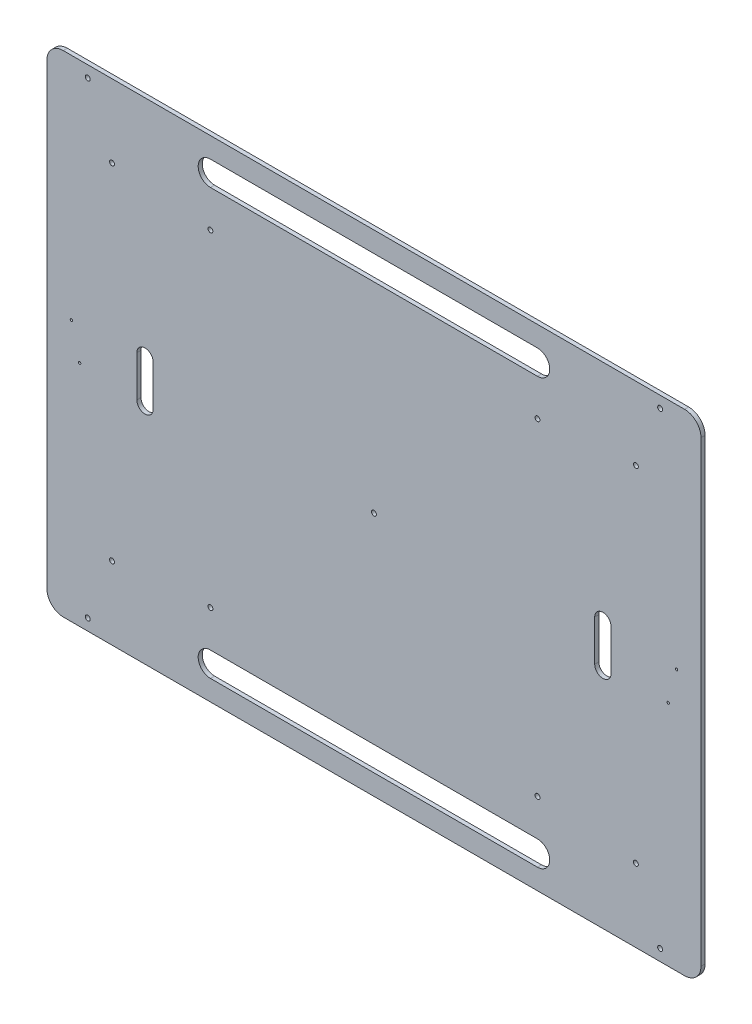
ISO-10303-21;
HEADER;
FILE_DESCRIPTION(('STEP AP214'),'2;1');
FILE_NAME('part.step','',(''),(''),'','','');
FILE_SCHEMA(('AUTOMOTIVE_DESIGN { 1 0 10303 214 1 1 1 1 }'));
ENDSEC;
DATA;
#1=APPLICATION_CONTEXT('core data for automotive mechanical design processes');
#2=APPLICATION_PROTOCOL_DEFINITION('international standard','automotive_design',2000,#1);
#3=PRODUCT_CONTEXT('',#1,'mechanical');
#4=PRODUCT('Part','Part','',(#3));
#5=PRODUCT_RELATED_PRODUCT_CATEGORY('part','',(#4));
#6=PRODUCT_DEFINITION_FORMATION('','',#4);
#7=PRODUCT_DEFINITION_CONTEXT('part definition',#1,'design');
#8=PRODUCT_DEFINITION('design','',#6,#7);
#9=PRODUCT_DEFINITION_SHAPE('','',#8);
#10=(LENGTH_UNIT() NAMED_UNIT(*) SI_UNIT(.MILLI.,.METRE.));
#11=(NAMED_UNIT(*) PLANE_ANGLE_UNIT() SI_UNIT($,.RADIAN.));
#12=(NAMED_UNIT(*) SI_UNIT($,.STERADIAN.) SOLID_ANGLE_UNIT());
#13=UNCERTAINTY_MEASURE_WITH_UNIT(LENGTH_MEASURE(1.E-05),#10,'distance_accuracy_value','');
#14=(GEOMETRIC_REPRESENTATION_CONTEXT(3) GLOBAL_UNCERTAINTY_ASSIGNED_CONTEXT((#13)) GLOBAL_UNIT_ASSIGNED_CONTEXT((#10,
#11,#12)) REPRESENTATION_CONTEXT('',''));
#15=CARTESIAN_POINT('',(0.,0.,0.));
#16=DIRECTION('',(0.,0.,1.));
#17=DIRECTION('',(1.,0.,0.));
#18=AXIS2_PLACEMENT_3D('',#15,#16,#17);
#19=CARTESIAN_POINT('',(0.,300.,5.));
#20=DIRECTION('',(0.,-1.,0.));
#21=DIRECTION('',(1.,0.,0.));
#22=AXIS2_PLACEMENT_3D('',#19,#20,#21);
#23=PLANE('',#22);
#24=DIRECTION('',(-1.,0.,0.));
#25=VECTOR('',#24,1.);
#26=CARTESIAN_POINT('',(0.,300.,5.));
#27=LINE('',#26,#25);
#28=CARTESIAN_POINT('',(-20.,300.,5.));
#29=VERTEX_POINT('',#28);
#30=CARTESIAN_POINT('',(-780.,300.,5.));
#31=VERTEX_POINT('',#30);
#32=EDGE_CURVE('E436',#29,#31,#27,.T.);
#33=ORIENTED_EDGE('',*,*,#32,.F.);
#34=DIRECTION('',(0.,0.,-1.));
#35=VECTOR('',#34,1.);
#36=CARTESIAN_POINT('',(-20.,300.,5.));
#37=LINE('',#36,#35);
#38=CARTESIAN_POINT('',(-20.,300.,0.));
#39=VERTEX_POINT('',#38);
#40=EDGE_CURVE('E11',#29,#39,#37,.T.);
#41=ORIENTED_EDGE('',*,*,#40,.T.);
#42=DIRECTION('',(-1.,0.,0.));
#43=VECTOR('',#42,1.);
#44=CARTESIAN_POINT('',(0.,300.,0.));
#45=LINE('',#44,#43);
#46=CARTESIAN_POINT('',(-780.,300.,0.));
#47=VERTEX_POINT('',#46);
#48=EDGE_CURVE('E427',#39,#47,#45,.T.);
#49=ORIENTED_EDGE('',*,*,#48,.T.);
#50=DIRECTION('',(0.,0.,-1.));
#51=VECTOR('',#50,1.);
#52=CARTESIAN_POINT('',(-780.,300.,5.));
#53=LINE('',#52,#51);
#54=EDGE_CURVE('E47',#47,#31,#53,.F.);
#55=ORIENTED_EDGE('',*,*,#54,.T.);
#56=EDGE_LOOP('',(#33,#41,#49,#55));
#57=FACE_BOUND('',#56,.T.);
#58=ADVANCED_FACE('F39',(#57),#23,.F.);
#59=CARTESIAN_POINT('',(-800.,300.,5.));
#60=DIRECTION('',(1.,0.,0.));
#61=DIRECTION('',(0.,1.,0.));
#62=AXIS2_PLACEMENT_3D('',#59,#60,#61);
#63=PLANE('',#62);
#64=DIRECTION('',(0.,-1.,0.));
#65=VECTOR('',#64,1.);
#66=CARTESIAN_POINT('',(-800.,300.,0.));
#67=LINE('',#66,#65);
#68=CARTESIAN_POINT('',(-800.,280.,0.));
#69=VERTEX_POINT('',#68);
#70=CARTESIAN_POINT('',(-800.,-280.,0.));
#71=VERTEX_POINT('',#70);
#72=EDGE_CURVE('E452',#69,#71,#67,.T.);
#73=ORIENTED_EDGE('',*,*,#72,.T.);
#74=DIRECTION('',(0.,0.,-1.));
#75=VECTOR('',#74,1.);
#76=CARTESIAN_POINT('',(-800.,-280.,5.));
#77=LINE('',#76,#75);
#78=CARTESIAN_POINT('',(-800.,-280.,5.));
#79=VERTEX_POINT('',#78);
#80=EDGE_CURVE('E475',#71,#79,#77,.F.);
#81=ORIENTED_EDGE('',*,*,#80,.T.);
#82=DIRECTION('',(0.,-1.,0.));
#83=VECTOR('',#82,1.);
#84=CARTESIAN_POINT('',(-800.,300.,5.));
#85=LINE('',#84,#83);
#86=CARTESIAN_POINT('',(-800.,280.,5.));
#87=VERTEX_POINT('',#86);
#88=EDGE_CURVE('E439',#87,#79,#85,.T.);
#89=ORIENTED_EDGE('',*,*,#88,.F.);
#90=DIRECTION('',(0.,0.,-1.));
#91=VECTOR('',#90,1.);
#92=CARTESIAN_POINT('',(-800.,280.,5.));
#93=LINE('',#92,#91);
#94=EDGE_CURVE('E472',#87,#69,#93,.T.);
#95=ORIENTED_EDGE('',*,*,#94,.T.);
#96=EDGE_LOOP('',(#73,#81,#89,#95));
#97=FACE_BOUND('',#96,.T.);
#98=ADVANCED_FACE('F503',(#97),#63,.F.);
#99=CARTESIAN_POINT('',(-800.,-300.,5.));
#100=DIRECTION('',(0.,1.,0.));
#101=DIRECTION('',(-1.,0.,0.));
#102=AXIS2_PLACEMENT_3D('',#99,#100,#101);
#103=PLANE('',#102);
#104=DIRECTION('',(1.,0.,0.));
#105=VECTOR('',#104,1.);
#106=CARTESIAN_POINT('',(-800.,-300.,5.));
#107=LINE('',#106,#105);
#108=CARTESIAN_POINT('',(-780.,-300.,5.));
#109=VERTEX_POINT('',#108);
#110=CARTESIAN_POINT('',(-19.9999999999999,-300.,5.));
#111=VERTEX_POINT('',#110);
#112=EDGE_CURVE('E443',#109,#111,#107,.T.);
#113=ORIENTED_EDGE('',*,*,#112,.F.);
#114=DIRECTION('',(0.,0.,-1.));
#115=VECTOR('',#114,1.);
#116=CARTESIAN_POINT('',(-780.,-300.,5.));
#117=LINE('',#116,#115);
#118=CARTESIAN_POINT('',(-780.,-300.,0.));
#119=VERTEX_POINT('',#118);
#120=EDGE_CURVE('E461',#109,#119,#117,.T.);
#121=ORIENTED_EDGE('',*,*,#120,.T.);
#122=DIRECTION('',(1.,0.,0.));
#123=VECTOR('',#122,1.);
#124=CARTESIAN_POINT('',(-800.,-300.,0.));
#125=LINE('',#124,#123);
#126=CARTESIAN_POINT('',(-19.9999999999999,-300.,0.));
#127=VERTEX_POINT('',#126);
#128=EDGE_CURVE('E455',#119,#127,#125,.T.);
#129=ORIENTED_EDGE('',*,*,#128,.T.);
#130=DIRECTION('',(0.,0.,-1.));
#131=VECTOR('',#130,1.);
#132=CARTESIAN_POINT('',(-19.9999999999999,-300.,5.));
#133=LINE('',#132,#131);
#134=EDGE_CURVE('E449',#127,#111,#133,.F.);
#135=ORIENTED_EDGE('',*,*,#134,.T.);
#136=EDGE_LOOP('',(#113,#121,#129,#135));
#137=FACE_BOUND('',#136,.T.);
#138=ADVANCED_FACE('F513',(#137),#103,.F.);
#139=CARTESIAN_POINT('',(0.,300.,5.));
#140=DIRECTION('',(-1.,0.,0.));
#141=DIRECTION('',(0.,-1.,0.));
#142=AXIS2_PLACEMENT_3D('',#139,#140,#141);
#143=PLANE('',#142);
#144=DIRECTION('',(0.,1.,0.));
#145=VECTOR('',#144,1.);
#146=CARTESIAN_POINT('',(0.,300.,5.));
#147=LINE('',#146,#145);
#148=CARTESIAN_POINT('',(1.08573008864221E-13,-280.,5.));
#149=VERTEX_POINT('',#148);
#150=CARTESIAN_POINT('',(0.,280.,5.));
#151=VERTEX_POINT('',#150);
#152=EDGE_CURVE('E446',#149,#151,#147,.T.);
#153=ORIENTED_EDGE('',*,*,#152,.F.);
#154=DIRECTION('',(0.,0.,-1.));
#155=VECTOR('',#154,1.);
#156=CARTESIAN_POINT('',(1.08573008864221E-13,-280.,5.));
#157=LINE('',#156,#155);
#158=CARTESIAN_POINT('',(1.08573008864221E-13,-280.,0.));
#159=VERTEX_POINT('',#158);
#160=EDGE_CURVE('E487',#149,#159,#157,.T.);
#161=ORIENTED_EDGE('',*,*,#160,.T.);
#162=DIRECTION('',(0.,1.,0.));
#163=VECTOR('',#162,1.);
#164=CARTESIAN_POINT('',(0.,300.,0.));
#165=LINE('',#164,#163);
#166=CARTESIAN_POINT('',(0.,280.,0.));
#167=VERTEX_POINT('',#166);
#168=EDGE_CURVE('E440',#159,#167,#165,.T.);
#169=ORIENTED_EDGE('',*,*,#168,.T.);
#170=DIRECTION('',(0.,0.,-1.));
#171=VECTOR('',#170,1.);
#172=CARTESIAN_POINT('',(0.,280.,5.));
#173=LINE('',#172,#171);
#174=EDGE_CURVE('E485',#167,#151,#173,.F.);
#175=ORIENTED_EDGE('',*,*,#174,.T.);
#176=EDGE_LOOP('',(#153,#161,#169,#175));
#177=FACE_BOUND('',#176,.T.);
#178=ADVANCED_FACE('F522',(#177),#143,.F.);
#179=CARTESIAN_POINT('',(0.,0.,5.));
#180=DIRECTION('',(0.,0.,1.));
#181=DIRECTION('',(1.,0.,0.));
#182=AXIS2_PLACEMENT_3D('',#179,#180,#181);
#183=PLANE('',#182);
#184=CARTESIAN_POINT('',(-600.,260.,5.));
#185=DIRECTION('',(0.,0.,1.));
#186=DIRECTION('',(1.,0.,0.));
#187=AXIS2_PLACEMENT_3D('',#184,#185,#186);
#188=CIRCLE('',#187,15.0000000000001);
#189=CARTESIAN_POINT('',(-600.,275.,5.));
#190=VERTEX_POINT('',#189);
#191=CARTESIAN_POINT('',(-600.,245.,5.));
#192=VERTEX_POINT('',#191);
#193=EDGE_CURVE('E54',#190,#192,#188,.T.);
#194=ORIENTED_EDGE('',*,*,#193,.F.);
#195=DIRECTION('',(-1.,0.,0.));
#196=VECTOR('',#195,1.);
#197=CARTESIAN_POINT('',(-600.,275.,5.));
#198=LINE('',#197,#196);
#199=CARTESIAN_POINT('',(-200.,275.,5.));
#200=VERTEX_POINT('',#199);
#201=EDGE_CURVE('E221',#200,#190,#198,.T.);
#202=ORIENTED_EDGE('',*,*,#201,.F.);
#203=CARTESIAN_POINT('',(-200.,260.,5.));
#204=DIRECTION('',(0.,0.,1.));
#205=DIRECTION('',(1.,0.,0.));
#206=AXIS2_PLACEMENT_3D('',#203,#204,#205);
#207=CIRCLE('',#206,15.0000000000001);
#208=CARTESIAN_POINT('',(-200.,245.,5.));
#209=VERTEX_POINT('',#208);
#210=EDGE_CURVE('E224',#209,#200,#207,.T.);
#211=ORIENTED_EDGE('',*,*,#210,.F.);
#212=DIRECTION('',(1.,0.,0.));
#213=VECTOR('',#212,1.);
#214=CARTESIAN_POINT('',(-600.,245.,5.));
#215=LINE('',#214,#213);
#216=EDGE_CURVE('E230',#192,#209,#215,.T.);
#217=ORIENTED_EDGE('',*,*,#216,.F.);
#218=EDGE_LOOP('',(#194,#202,#211,#217));
#219=FACE_BOUND('',#218,.T.);
#220=CARTESIAN_POINT('',(-600.,-260.,5.));
#221=DIRECTION('',(0.,0.,1.));
#222=DIRECTION('',(-1.,0.,0.));
#223=AXIS2_PLACEMENT_3D('',#220,#221,#222);
#224=CIRCLE('',#223,15.0000000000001);
#225=CARTESIAN_POINT('',(-600.,-245.,5.));
#226=VERTEX_POINT('',#225);
#227=CARTESIAN_POINT('',(-600.,-275.,5.));
#228=VERTEX_POINT('',#227);
#229=EDGE_CURVE('E62',#226,#228,#224,.T.);
#230=ORIENTED_EDGE('',*,*,#229,.F.);
#231=DIRECTION('',(-1.,0.,0.));
#232=VECTOR('',#231,1.);
#233=CARTESIAN_POINT('',(-600.,-245.,5.));
#234=LINE('',#233,#232);
#235=CARTESIAN_POINT('',(-200.,-245.,5.));
#236=VERTEX_POINT('',#235);
#237=EDGE_CURVE('E249',#236,#226,#234,.T.);
#238=ORIENTED_EDGE('',*,*,#237,.F.);
#239=CARTESIAN_POINT('',(-200.,-260.,5.));
#240=DIRECTION('',(0.,0.,1.));
#241=DIRECTION('',(-1.,0.,0.));
#242=AXIS2_PLACEMENT_3D('',#239,#240,#241);
#243=CIRCLE('',#242,15.);
#244=CARTESIAN_POINT('',(-200.,-275.,5.));
#245=VERTEX_POINT('',#244);
#246=EDGE_CURVE('E252',#245,#236,#243,.T.);
#247=ORIENTED_EDGE('',*,*,#246,.F.);
#248=DIRECTION('',(1.,0.,0.));
#249=VECTOR('',#248,1.);
#250=CARTESIAN_POINT('',(-600.,-275.,5.));
#251=LINE('',#250,#249);
#252=EDGE_CURVE('E256',#228,#245,#251,.T.);
#253=ORIENTED_EDGE('',*,*,#252,.F.);
#254=EDGE_LOOP('',(#230,#238,#247,#253));
#255=FACE_BOUND('',#254,.T.);
#256=CARTESIAN_POINT('',(-720.355339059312,-210.710678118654,5.));
#257=DIRECTION('',(0.,0.,1.));
#258=DIRECTION('',(1.,0.,0.));
#259=AXIS2_PLACEMENT_3D('',#256,#257,#258);
#260=CIRCLE('',#259,2.99999999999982);
#261=CARTESIAN_POINT('',(-717.355339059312,-210.710678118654,5.));
#262=VERTEX_POINT('',#261);
#263=EDGE_CURVE('E283',#262,#262,#260,.T.);
#264=ORIENTED_EDGE('',*,*,#263,.F.);
#265=EDGE_LOOP('',(#264));
#266=FACE_BOUND('',#265,.T.);
#267=CARTESIAN_POINT('',(-79.6446609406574,-210.710678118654,5.));
#268=DIRECTION('',(0.,0.,1.));
#269=DIRECTION('',(1.,0.,0.));
#270=AXIS2_PLACEMENT_3D('',#267,#268,#269);
#271=CIRCLE('',#270,2.99999999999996);
#272=CARTESIAN_POINT('',(-76.6446609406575,-210.710678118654,5.));
#273=VERTEX_POINT('',#272);
#274=EDGE_CURVE('E277',#273,#273,#271,.T.);
#275=ORIENTED_EDGE('',*,*,#274,.F.);
#276=EDGE_LOOP('',(#275));
#277=FACE_BOUND('',#276,.T.);
#278=CARTESIAN_POINT('',(-79.6446609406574,210.710678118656,5.));
#279=DIRECTION('',(0.,0.,1.));
#280=DIRECTION('',(1.,0.,0.));
#281=AXIS2_PLACEMENT_3D('',#278,#279,#280);
#282=CIRCLE('',#281,3.00000000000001);
#283=CARTESIAN_POINT('',(-76.6446609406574,210.710678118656,5.));
#284=VERTEX_POINT('',#283);
#285=EDGE_CURVE('E270',#284,#284,#282,.T.);
#286=ORIENTED_EDGE('',*,*,#285,.F.);
#287=EDGE_LOOP('',(#286));
#288=FACE_BOUND('',#287,.T.);
#289=CARTESIAN_POINT('',(-720.355339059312,210.710678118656,5.));
#290=DIRECTION('',(0.,0.,1.));
#291=DIRECTION('',(1.,0.,0.));
#292=AXIS2_PLACEMENT_3D('',#289,#290,#291);
#293=CIRCLE('',#292,2.99999999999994);
#294=CARTESIAN_POINT('',(-717.355339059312,210.710678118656,5.));
#295=VERTEX_POINT('',#294);
#296=EDGE_CURVE('E273',#295,#295,#293,.T.);
#297=ORIENTED_EDGE('',*,*,#296,.F.);
#298=EDGE_LOOP('',(#297));
#299=FACE_BOUND('',#298,.T.);
#300=CARTESIAN_POINT('',(-400.,0.,5.));
#301=DIRECTION('',(0.,0.,1.));
#302=DIRECTION('',(1.,0.,0.));
#303=AXIS2_PLACEMENT_3D('',#300,#301,#302);
#304=CIRCLE('',#303,2.99999999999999);
#305=CARTESIAN_POINT('',(-397.,0.,5.));
#306=VERTEX_POINT('',#305);
#307=EDGE_CURVE('E313',#306,#306,#304,.T.);
#308=ORIENTED_EDGE('',*,*,#307,.F.);
#309=EDGE_LOOP('',(#308));
#310=FACE_BOUND('',#309,.T.);
#311=CARTESIAN_POINT('',(-600.,-200.,5.));
#312=DIRECTION('',(0.,0.,1.));
#313=DIRECTION('',(1.,0.,0.));
#314=AXIS2_PLACEMENT_3D('',#311,#312,#313);
#315=CIRCLE('',#314,2.99999999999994);
#316=CARTESIAN_POINT('',(-597.,-200.,5.));
#317=VERTEX_POINT('',#316);
#318=EDGE_CURVE('E307',#317,#317,#315,.T.);
#319=ORIENTED_EDGE('',*,*,#318,.F.);
#320=EDGE_LOOP('',(#319));
#321=FACE_BOUND('',#320,.T.);
#322=CARTESIAN_POINT('',(-200.,-200.,5.));
#323=DIRECTION('',(0.,0.,1.));
#324=DIRECTION('',(1.,0.,0.));
#325=AXIS2_PLACEMENT_3D('',#322,#323,#324);
#326=CIRCLE('',#325,2.99999999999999);
#327=CARTESIAN_POINT('',(-197.,-200.,5.));
#328=VERTEX_POINT('',#327);
#329=EDGE_CURVE('E301',#328,#328,#326,.T.);
#330=ORIENTED_EDGE('',*,*,#329,.F.);
#331=EDGE_LOOP('',(#330));
#332=FACE_BOUND('',#331,.T.);
#333=CARTESIAN_POINT('',(-200.,200.,5.));
#334=DIRECTION('',(0.,0.,1.));
#335=DIRECTION('',(1.,0.,0.));
#336=AXIS2_PLACEMENT_3D('',#333,#334,#335);
#337=CIRCLE('',#336,2.99999999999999);
#338=CARTESIAN_POINT('',(-197.,200.,5.));
#339=VERTEX_POINT('',#338);
#340=EDGE_CURVE('E294',#339,#339,#337,.T.);
#341=ORIENTED_EDGE('',*,*,#340,.F.);
#342=EDGE_LOOP('',(#341));
#343=FACE_BOUND('',#342,.T.);
#344=CARTESIAN_POINT('',(-600.,200.,5.));
#345=DIRECTION('',(0.,0.,1.));
#346=DIRECTION('',(1.,0.,0.));
#347=AXIS2_PLACEMENT_3D('',#344,#345,#346);
#348=CIRCLE('',#347,3.00000000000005);
#349=CARTESIAN_POINT('',(-597.,200.,5.));
#350=VERTEX_POINT('',#349);
#351=EDGE_CURVE('E297',#350,#350,#348,.T.);
#352=ORIENTED_EDGE('',*,*,#351,.F.);
#353=EDGE_LOOP('',(#352));
#354=FACE_BOUND('',#353,.T.);
#355=CARTESIAN_POINT('',(-749.999999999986,-285.999999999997,5.));
#356=DIRECTION('',(0.,0.,-1.));
#357=DIRECTION('',(-1.,0.,0.));
#358=AXIS2_PLACEMENT_3D('',#355,#356,#357);
#359=CIRCLE('',#358,3.00000000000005);
#360=CARTESIAN_POINT('',(-752.999999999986,-285.999999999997,5.));
#361=VERTEX_POINT('',#360);
#362=EDGE_CURVE('E334',#361,#361,#359,.T.);
#363=ORIENTED_EDGE('',*,*,#362,.T.);
#364=EDGE_LOOP('',(#363));
#365=FACE_BOUND('',#364,.T.);
#366=CARTESIAN_POINT('',(-49.9999999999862,286.000000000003,5.));
#367=DIRECTION('',(0.,0.,-1.));
#368=DIRECTION('',(-1.,0.,0.));
#369=AXIS2_PLACEMENT_3D('',#366,#367,#368);
#370=CIRCLE('',#369,3.00000000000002);
#371=CARTESIAN_POINT('',(-52.9999999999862,286.000000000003,5.));
#372=VERTEX_POINT('',#371);
#373=EDGE_CURVE('E327',#372,#372,#370,.T.);
#374=ORIENTED_EDGE('',*,*,#373,.T.);
#375=EDGE_LOOP('',(#374));
#376=FACE_BOUND('',#375,.T.);
#377=CARTESIAN_POINT('',(-749.999999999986,286.000000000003,5.));
#378=DIRECTION('',(0.,0.,-1.));
#379=DIRECTION('',(-1.,0.,0.));
#380=AXIS2_PLACEMENT_3D('',#377,#378,#379);
#381=CIRCLE('',#380,2.99999999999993);
#382=CARTESIAN_POINT('',(-752.999999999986,286.000000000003,5.));
#383=VERTEX_POINT('',#382);
#384=EDGE_CURVE('E321',#383,#383,#381,.T.);
#385=ORIENTED_EDGE('',*,*,#384,.T.);
#386=EDGE_LOOP('',(#385));
#387=FACE_BOUND('',#386,.T.);
#388=CARTESIAN_POINT('',(-49.9999999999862,-285.999999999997,5.));
#389=DIRECTION('',(0.,0.,-1.));
#390=DIRECTION('',(-1.,0.,0.));
#391=AXIS2_PLACEMENT_3D('',#388,#389,#390);
#392=CIRCLE('',#391,3.00000000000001);
#393=CARTESIAN_POINT('',(-52.9999999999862,-285.999999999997,5.));
#394=VERTEX_POINT('',#393);
#395=EDGE_CURVE('E342',#394,#394,#392,.T.);
#396=ORIENTED_EDGE('',*,*,#395,.T.);
#397=EDGE_LOOP('',(#396));
#398=FACE_BOUND('',#397,.T.);
#399=CARTESIAN_POINT('',(-680.,25.,5.));
#400=DIRECTION('',(0.,0.,1.));
#401=DIRECTION('',(1.,0.,0.));
#402=AXIS2_PLACEMENT_3D('',#399,#400,#401);
#403=CIRCLE('',#402,10.0000000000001);
#404=CARTESIAN_POINT('',(-670.,25.,5.));
#405=VERTEX_POINT('',#404);
#406=CARTESIAN_POINT('',(-690.,25.,5.));
#407=VERTEX_POINT('',#406);
#408=EDGE_CURVE('E362',#405,#407,#403,.T.);
#409=ORIENTED_EDGE('',*,*,#408,.F.);
#410=DIRECTION('',(0.,1.,0.));
#411=VECTOR('',#410,1.);
#412=CARTESIAN_POINT('',(-670.,25.,5.));
#413=LINE('',#412,#411);
#414=CARTESIAN_POINT('',(-670.,-25.,5.));
#415=VERTEX_POINT('',#414);
#416=EDGE_CURVE('E352',#415,#405,#413,.T.);
#417=ORIENTED_EDGE('',*,*,#416,.F.);
#418=CARTESIAN_POINT('',(-680.,-25.,5.));
#419=DIRECTION('',(0.,0.,1.));
#420=DIRECTION('',(1.,0.,0.));
#421=AXIS2_PLACEMENT_3D('',#418,#419,#420);
#422=CIRCLE('',#421,10.0000000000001);
#423=CARTESIAN_POINT('',(-690.,-25.,5.));
#424=VERTEX_POINT('',#423);
#425=EDGE_CURVE('E368',#424,#415,#422,.T.);
#426=ORIENTED_EDGE('',*,*,#425,.F.);
#427=DIRECTION('',(0.,-1.,0.));
#428=VECTOR('',#427,1.);
#429=CARTESIAN_POINT('',(-690.,25.,5.));
#430=LINE('',#429,#428);
#431=EDGE_CURVE('E364',#407,#424,#430,.T.);
#432=ORIENTED_EDGE('',*,*,#431,.F.);
#433=EDGE_LOOP('',(#409,#417,#426,#432));
#434=FACE_BOUND('',#433,.T.);
#435=CARTESIAN_POINT('',(-120.,25.0000000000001,5.));
#436=DIRECTION('',(0.,0.,1.));
#437=DIRECTION('',(-1.,0.,0.));
#438=AXIS2_PLACEMENT_3D('',#435,#436,#437);
#439=CIRCLE('',#438,10.0000000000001);
#440=CARTESIAN_POINT('',(-110.,25.0000000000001,5.));
#441=VERTEX_POINT('',#440);
#442=CARTESIAN_POINT('',(-130.,25.0000000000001,5.));
#443=VERTEX_POINT('',#442);
#444=EDGE_CURVE('E365',#441,#443,#439,.T.);
#445=ORIENTED_EDGE('',*,*,#444,.F.);
#446=DIRECTION('',(0.,1.,0.));
#447=VECTOR('',#446,1.);
#448=CARTESIAN_POINT('',(-110.,25.0000000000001,5.));
#449=LINE('',#448,#447);
#450=CARTESIAN_POINT('',(-110.,-24.9999999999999,5.));
#451=VERTEX_POINT('',#450);
#452=EDGE_CURVE('E391',#451,#441,#449,.T.);
#453=ORIENTED_EDGE('',*,*,#452,.F.);
#454=CARTESIAN_POINT('',(-120.,-24.9999999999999,5.));
#455=DIRECTION('',(0.,0.,1.));
#456=DIRECTION('',(-1.,0.,0.));
#457=AXIS2_PLACEMENT_3D('',#454,#455,#456);
#458=CIRCLE('',#457,10.0000000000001);
#459=CARTESIAN_POINT('',(-130.,-24.9999999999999,5.));
#460=VERTEX_POINT('',#459);
#461=EDGE_CURVE('E394',#460,#451,#458,.T.);
#462=ORIENTED_EDGE('',*,*,#461,.F.);
#463=DIRECTION('',(0.,-1.,0.));
#464=VECTOR('',#463,1.);
#465=CARTESIAN_POINT('',(-130.,25.0000000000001,5.));
#466=LINE('',#465,#464);
#467=EDGE_CURVE('E398',#443,#460,#466,.T.);
#468=ORIENTED_EDGE('',*,*,#467,.F.);
#469=EDGE_LOOP('',(#445,#453,#462,#468));
#470=FACE_BOUND('',#469,.T.);
#471=CARTESIAN_POINT('',(-29.9700628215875,19.6356832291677,5.));
#472=DIRECTION('',(0.,0.,1.));
#473=DIRECTION('',(1.,0.,0.));
#474=AXIS2_PLACEMENT_3D('',#471,#472,#473);
#475=CIRCLE('',#474,1.50000000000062);
#476=CARTESIAN_POINT('',(-28.4700628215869,19.6356832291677,5.));
#477=VERTEX_POINT('',#476);
#478=EDGE_CURVE('E416',#477,#477,#475,.T.);
#479=ORIENTED_EDGE('',*,*,#478,.F.);
#480=EDGE_LOOP('',(#479));
#481=FACE_BOUND('',#480,.T.);
#482=CARTESIAN_POINT('',(-770.029937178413,19.6356832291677,5.));
#483=DIRECTION('',(0.,0.,1.));
#484=DIRECTION('',(-1.,0.,0.));
#485=AXIS2_PLACEMENT_3D('',#482,#483,#484);
#486=CIRCLE('',#485,1.50000000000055);
#487=CARTESIAN_POINT('',(-771.529937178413,19.6356832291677,5.));
#488=VERTEX_POINT('',#487);
#489=EDGE_CURVE('E419',#488,#488,#486,.T.);
#490=ORIENTED_EDGE('',*,*,#489,.F.);
#491=EDGE_LOOP('',(#490));
#492=FACE_BOUND('',#491,.T.);
#493=CARTESIAN_POINT('',(-760.,-20.8600000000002,5.));
#494=DIRECTION('',(0.,0.,1.));
#495=DIRECTION('',(-1.,0.,0.));
#496=AXIS2_PLACEMENT_3D('',#493,#494,#495);
#497=CIRCLE('',#496,1.49999999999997);
#498=CARTESIAN_POINT('',(-761.5,-20.8600000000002,5.));
#499=VERTEX_POINT('',#498);
#500=EDGE_CURVE('E428',#499,#499,#497,.T.);
#501=ORIENTED_EDGE('',*,*,#500,.F.);
#502=EDGE_LOOP('',(#501));
#503=FACE_BOUND('',#502,.T.);
#504=CARTESIAN_POINT('',(-40.,-20.8600000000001,5.));
#505=DIRECTION('',(0.,0.,1.));
#506=DIRECTION('',(1.,0.,0.));
#507=AXIS2_PLACEMENT_3D('',#504,#505,#506);
#508=CIRCLE('',#507,1.49999999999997);
#509=CARTESIAN_POINT('',(-38.5000000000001,-20.8600000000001,5.));
#510=VERTEX_POINT('',#509);
#511=EDGE_CURVE('E431',#510,#510,#508,.T.);
#512=ORIENTED_EDGE('',*,*,#511,.F.);
#513=EDGE_LOOP('',(#512));
#514=FACE_BOUND('',#513,.T.);
#515=ORIENTED_EDGE('',*,*,#88,.T.);
#516=CARTESIAN_POINT('',(-780.,-280.,5.));
#517=DIRECTION('',(0.,0.,1.));
#518=DIRECTION('',(1.,0.,0.));
#519=AXIS2_PLACEMENT_3D('',#516,#517,#518);
#520=CIRCLE('',#519,20.);
#521=EDGE_CURVE('E483',#79,#109,#520,.T.);
#522=ORIENTED_EDGE('',*,*,#521,.T.);
#523=ORIENTED_EDGE('',*,*,#112,.T.);
#524=CARTESIAN_POINT('',(-19.9999999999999,-280.,5.));
#525=DIRECTION('',(0.,0.,1.));
#526=DIRECTION('',(1.,0.,0.));
#527=AXIS2_PLACEMENT_3D('',#524,#525,#526);
#528=CIRCLE('',#527,20.);
#529=EDGE_CURVE('E481',#111,#149,#528,.T.);
#530=ORIENTED_EDGE('',*,*,#529,.T.);
#531=ORIENTED_EDGE('',*,*,#152,.T.);
#532=CARTESIAN_POINT('',(-20.,280.,5.));
#533=DIRECTION('',(0.,0.,1.));
#534=DIRECTION('',(1.,0.,0.));
#535=AXIS2_PLACEMENT_3D('',#532,#533,#534);
#536=CIRCLE('',#535,20.);
#537=EDGE_CURVE('E479',#151,#29,#536,.T.);
#538=ORIENTED_EDGE('',*,*,#537,.T.);
#539=ORIENTED_EDGE('',*,*,#32,.T.);
#540=CARTESIAN_POINT('',(-780.,280.,5.));
#541=DIRECTION('',(0.,0.,1.));
#542=DIRECTION('',(1.,0.,0.));
#543=AXIS2_PLACEMENT_3D('',#540,#541,#542);
#544=CIRCLE('',#543,20.);
#545=EDGE_CURVE('E477',#31,#87,#544,.T.);
#546=ORIENTED_EDGE('',*,*,#545,.T.);
#547=EDGE_LOOP('',(#515,#522,#523,#530,#531,#538,#539,#546));
#548=FACE_BOUND('',#547,.T.);
#549=ADVANCED_FACE('F497',(#219,#255,#266,#277,#288,#299,#310,#321,#332,#343,#354,#365,#376,
#387,#398,#434,#470,#481,#492,#503,#514,#548),#183,.T.);
#550=CARTESIAN_POINT('',(0.,0.,0.));
#551=DIRECTION('',(0.,0.,1.));
#552=DIRECTION('',(1.,0.,0.));
#553=AXIS2_PLACEMENT_3D('',#550,#551,#552);
#554=PLANE('',#553);
#555=DIRECTION('',(-1.,0.,0.));
#556=VECTOR('',#555,1.);
#557=CARTESIAN_POINT('',(-600.,275.,0.));
#558=LINE('',#557,#556);
#559=CARTESIAN_POINT('',(-200.,275.,0.));
#560=VERTEX_POINT('',#559);
#561=CARTESIAN_POINT('',(-600.,275.,0.));
#562=VERTEX_POINT('',#561);
#563=EDGE_CURVE('E208',#560,#562,#558,.T.);
#564=ORIENTED_EDGE('',*,*,#563,.T.);
#565=CARTESIAN_POINT('',(-600.,260.,0.));
#566=DIRECTION('',(0.,0.,1.));
#567=DIRECTION('',(1.,0.,0.));
#568=AXIS2_PLACEMENT_3D('',#565,#566,#567);
#569=CIRCLE('',#568,15.0000000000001);
#570=CARTESIAN_POINT('',(-600.,245.,0.));
#571=VERTEX_POINT('',#570);
#572=EDGE_CURVE('E202',#562,#571,#569,.T.);
#573=ORIENTED_EDGE('',*,*,#572,.T.);
#574=DIRECTION('',(1.,0.,0.));
#575=VECTOR('',#574,1.);
#576=CARTESIAN_POINT('',(-600.,245.,0.));
#577=LINE('',#576,#575);
#578=CARTESIAN_POINT('',(-200.,245.,0.));
#579=VERTEX_POINT('',#578);
#580=EDGE_CURVE('E212',#571,#579,#577,.T.);
#581=ORIENTED_EDGE('',*,*,#580,.T.);
#582=CARTESIAN_POINT('',(-200.,260.,0.));
#583=DIRECTION('',(0.,0.,1.));
#584=DIRECTION('',(1.,0.,0.));
#585=AXIS2_PLACEMENT_3D('',#582,#583,#584);
#586=CIRCLE('',#585,15.0000000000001);
#587=EDGE_CURVE('E216',#579,#560,#586,.T.);
#588=ORIENTED_EDGE('',*,*,#587,.T.);
#589=EDGE_LOOP('',(#564,#573,#581,#588));
#590=FACE_BOUND('',#589,.T.);
#591=DIRECTION('',(-1.,0.,0.));
#592=VECTOR('',#591,1.);
#593=CARTESIAN_POINT('',(-600.,-245.,0.));
#594=LINE('',#593,#592);
#595=CARTESIAN_POINT('',(-200.,-245.,0.));
#596=VERTEX_POINT('',#595);
#597=CARTESIAN_POINT('',(-600.,-245.,0.));
#598=VERTEX_POINT('',#597);
#599=EDGE_CURVE('E242',#596,#598,#594,.T.);
#600=ORIENTED_EDGE('',*,*,#599,.T.);
#601=CARTESIAN_POINT('',(-600.,-260.,0.));
#602=DIRECTION('',(0.,0.,1.));
#603=DIRECTION('',(-1.,0.,0.));
#604=AXIS2_PLACEMENT_3D('',#601,#602,#603);
#605=CIRCLE('',#604,15.0000000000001);
#606=CARTESIAN_POINT('',(-600.,-275.,0.));
#607=VERTEX_POINT('',#606);
#608=EDGE_CURVE('E253',#598,#607,#605,.T.);
#609=ORIENTED_EDGE('',*,*,#608,.T.);
#610=DIRECTION('',(1.,0.,0.));
#611=VECTOR('',#610,1.);
#612=CARTESIAN_POINT('',(-600.,-275.,0.));
#613=LINE('',#612,#611);
#614=CARTESIAN_POINT('',(-200.,-275.,0.));
#615=VERTEX_POINT('',#614);
#616=EDGE_CURVE('E265',#607,#615,#613,.T.);
#617=ORIENTED_EDGE('',*,*,#616,.T.);
#618=CARTESIAN_POINT('',(-200.,-260.,0.));
#619=DIRECTION('',(0.,0.,1.));
#620=DIRECTION('',(-1.,0.,0.));
#621=AXIS2_PLACEMENT_3D('',#618,#619,#620);
#622=CIRCLE('',#621,15.);
#623=EDGE_CURVE('E262',#615,#596,#622,.T.);
#624=ORIENTED_EDGE('',*,*,#623,.T.);
#625=EDGE_LOOP('',(#600,#609,#617,#624));
#626=FACE_BOUND('',#625,.T.);
#627=CARTESIAN_POINT('',(-720.355339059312,-210.710678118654,0.));
#628=DIRECTION('',(0.,0.,1.));
#629=DIRECTION('',(1.,0.,0.));
#630=AXIS2_PLACEMENT_3D('',#627,#628,#629);
#631=CIRCLE('',#630,2.99999999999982);
#632=CARTESIAN_POINT('',(-717.355339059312,-210.710678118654,0.));
#633=VERTEX_POINT('',#632);
#634=EDGE_CURVE('E236',#633,#633,#631,.T.);
#635=ORIENTED_EDGE('',*,*,#634,.T.);
#636=EDGE_LOOP('',(#635));
#637=FACE_BOUND('',#636,.T.);
#638=CARTESIAN_POINT('',(-79.6446609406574,-210.710678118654,0.));
#639=DIRECTION('',(0.,0.,1.));
#640=DIRECTION('',(1.,0.,0.));
#641=AXIS2_PLACEMENT_3D('',#638,#639,#640);
#642=CIRCLE('',#641,2.99999999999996);
#643=CARTESIAN_POINT('',(-76.6446609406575,-210.710678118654,0.));
#644=VERTEX_POINT('',#643);
#645=EDGE_CURVE('E280',#644,#644,#642,.T.);
#646=ORIENTED_EDGE('',*,*,#645,.T.);
#647=EDGE_LOOP('',(#646));
#648=FACE_BOUND('',#647,.T.);
#649=CARTESIAN_POINT('',(-79.6446609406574,210.710678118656,0.));
#650=DIRECTION('',(0.,0.,1.));
#651=DIRECTION('',(1.,0.,0.));
#652=AXIS2_PLACEMENT_3D('',#649,#650,#651);
#653=CIRCLE('',#652,3.00000000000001);
#654=CARTESIAN_POINT('',(-76.6446609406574,210.710678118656,0.));
#655=VERTEX_POINT('',#654);
#656=EDGE_CURVE('E274',#655,#655,#653,.T.);
#657=ORIENTED_EDGE('',*,*,#656,.T.);
#658=EDGE_LOOP('',(#657));
#659=FACE_BOUND('',#658,.T.);
#660=CARTESIAN_POINT('',(-720.355339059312,210.710678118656,0.));
#661=DIRECTION('',(0.,0.,1.));
#662=DIRECTION('',(1.,0.,0.));
#663=AXIS2_PLACEMENT_3D('',#660,#661,#662);
#664=CIRCLE('',#663,2.99999999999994);
#665=CARTESIAN_POINT('',(-717.355339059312,210.710678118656,0.));
#666=VERTEX_POINT('',#665);
#667=EDGE_CURVE('E288',#666,#666,#664,.T.);
#668=ORIENTED_EDGE('',*,*,#667,.T.);
#669=EDGE_LOOP('',(#668));
#670=FACE_BOUND('',#669,.T.);
#671=CARTESIAN_POINT('',(-400.,0.,0.));
#672=DIRECTION('',(0.,0.,1.));
#673=DIRECTION('',(1.,0.,0.));
#674=AXIS2_PLACEMENT_3D('',#671,#672,#673);
#675=CIRCLE('',#674,2.99999999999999);
#676=CARTESIAN_POINT('',(-397.,0.,0.));
#677=VERTEX_POINT('',#676);
#678=EDGE_CURVE('E291',#677,#677,#675,.T.);
#679=ORIENTED_EDGE('',*,*,#678,.T.);
#680=EDGE_LOOP('',(#679));
#681=FACE_BOUND('',#680,.T.);
#682=CARTESIAN_POINT('',(-600.,-200.,0.));
#683=DIRECTION('',(0.,0.,1.));
#684=DIRECTION('',(1.,0.,0.));
#685=AXIS2_PLACEMENT_3D('',#682,#683,#684);
#686=CIRCLE('',#685,2.99999999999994);
#687=CARTESIAN_POINT('',(-597.,-200.,0.));
#688=VERTEX_POINT('',#687);
#689=EDGE_CURVE('E310',#688,#688,#686,.T.);
#690=ORIENTED_EDGE('',*,*,#689,.T.);
#691=EDGE_LOOP('',(#690));
#692=FACE_BOUND('',#691,.T.);
#693=CARTESIAN_POINT('',(-200.,-200.,0.));
#694=DIRECTION('',(0.,0.,1.));
#695=DIRECTION('',(1.,0.,0.));
#696=AXIS2_PLACEMENT_3D('',#693,#694,#695);
#697=CIRCLE('',#696,2.99999999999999);
#698=CARTESIAN_POINT('',(-197.,-200.,0.));
#699=VERTEX_POINT('',#698);
#700=EDGE_CURVE('E304',#699,#699,#697,.T.);
#701=ORIENTED_EDGE('',*,*,#700,.T.);
#702=EDGE_LOOP('',(#701));
#703=FACE_BOUND('',#702,.T.);
#704=CARTESIAN_POINT('',(-200.,200.,0.));
#705=DIRECTION('',(0.,0.,1.));
#706=DIRECTION('',(1.,0.,0.));
#707=AXIS2_PLACEMENT_3D('',#704,#705,#706);
#708=CIRCLE('',#707,2.99999999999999);
#709=CARTESIAN_POINT('',(-197.,200.,0.));
#710=VERTEX_POINT('',#709);
#711=EDGE_CURVE('E298',#710,#710,#708,.T.);
#712=ORIENTED_EDGE('',*,*,#711,.T.);
#713=EDGE_LOOP('',(#712));
#714=FACE_BOUND('',#713,.T.);
#715=CARTESIAN_POINT('',(-600.,200.,0.));
#716=DIRECTION('',(0.,0.,1.));
#717=DIRECTION('',(1.,0.,0.));
#718=AXIS2_PLACEMENT_3D('',#715,#716,#717);
#719=CIRCLE('',#718,3.00000000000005);
#720=CARTESIAN_POINT('',(-597.,200.,0.));
#721=VERTEX_POINT('',#720);
#722=EDGE_CURVE('E318',#721,#721,#719,.T.);
#723=ORIENTED_EDGE('',*,*,#722,.T.);
#724=EDGE_LOOP('',(#723));
#725=FACE_BOUND('',#724,.T.);
#726=CARTESIAN_POINT('',(-749.999999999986,-285.999999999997,0.));
#727=DIRECTION('',(0.,0.,-1.));
#728=DIRECTION('',(-1.,0.,0.));
#729=AXIS2_PLACEMENT_3D('',#726,#727,#728);
#730=CIRCLE('',#729,3.00000000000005);
#731=CARTESIAN_POINT('',(-752.999999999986,-285.999999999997,0.));
#732=VERTEX_POINT('',#731);
#733=EDGE_CURVE('E330',#732,#732,#730,.T.);
#734=ORIENTED_EDGE('',*,*,#733,.F.);
#735=EDGE_LOOP('',(#734));
#736=FACE_BOUND('',#735,.T.);
#737=CARTESIAN_POINT('',(-49.9999999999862,286.000000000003,0.));
#738=DIRECTION('',(0.,0.,-1.));
#739=DIRECTION('',(-1.,0.,0.));
#740=AXIS2_PLACEMENT_3D('',#737,#738,#739);
#741=CIRCLE('',#740,3.00000000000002);
#742=CARTESIAN_POINT('',(-52.9999999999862,286.000000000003,0.));
#743=VERTEX_POINT('',#742);
#744=EDGE_CURVE('E337',#743,#743,#741,.T.);
#745=ORIENTED_EDGE('',*,*,#744,.F.);
#746=EDGE_LOOP('',(#745));
#747=FACE_BOUND('',#746,.T.);
#748=CARTESIAN_POINT('',(-749.999999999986,286.000000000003,0.));
#749=DIRECTION('',(0.,0.,-1.));
#750=DIRECTION('',(-1.,0.,0.));
#751=AXIS2_PLACEMENT_3D('',#748,#749,#750);
#752=CIRCLE('',#751,2.99999999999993);
#753=CARTESIAN_POINT('',(-752.999999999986,286.000000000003,0.));
#754=VERTEX_POINT('',#753);
#755=EDGE_CURVE('E324',#754,#754,#752,.T.);
#756=ORIENTED_EDGE('',*,*,#755,.F.);
#757=EDGE_LOOP('',(#756));
#758=FACE_BOUND('',#757,.T.);
#759=CARTESIAN_POINT('',(-49.9999999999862,-285.999999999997,0.));
#760=DIRECTION('',(0.,0.,-1.));
#761=DIRECTION('',(-1.,0.,0.));
#762=AXIS2_PLACEMENT_3D('',#759,#760,#761);
#763=CIRCLE('',#762,3.00000000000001);
#764=CARTESIAN_POINT('',(-52.9999999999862,-285.999999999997,0.));
#765=VERTEX_POINT('',#764);
#766=EDGE_CURVE('E333',#765,#765,#763,.T.);
#767=ORIENTED_EDGE('',*,*,#766,.F.);
#768=EDGE_LOOP('',(#767));
#769=FACE_BOUND('',#768,.T.);
#770=DIRECTION('',(0.,1.,0.));
#771=VECTOR('',#770,1.);
#772=CARTESIAN_POINT('',(-670.,25.,0.));
#773=LINE('',#772,#771);
#774=CARTESIAN_POINT('',(-670.,-25.,0.));
#775=VERTEX_POINT('',#774);
#776=CARTESIAN_POINT('',(-670.,25.,0.));
#777=VERTEX_POINT('',#776);
#778=EDGE_CURVE('E358',#775,#777,#773,.T.);
#779=ORIENTED_EDGE('',*,*,#778,.T.);
#780=CARTESIAN_POINT('',(-680.,25.,0.));
#781=DIRECTION('',(0.,0.,1.));
#782=DIRECTION('',(1.,0.,0.));
#783=AXIS2_PLACEMENT_3D('',#780,#781,#782);
#784=CIRCLE('',#783,10.0000000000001);
#785=CARTESIAN_POINT('',(-690.,25.,0.));
#786=VERTEX_POINT('',#785);
#787=EDGE_CURVE('E348',#777,#786,#784,.T.);
#788=ORIENTED_EDGE('',*,*,#787,.T.);
#789=DIRECTION('',(0.,-1.,0.));
#790=VECTOR('',#789,1.);
#791=CARTESIAN_POINT('',(-690.,25.,0.));
#792=LINE('',#791,#790);
#793=CARTESIAN_POINT('',(-690.,-25.,0.));
#794=VERTEX_POINT('',#793);
#795=EDGE_CURVE('E351',#786,#794,#792,.T.);
#796=ORIENTED_EDGE('',*,*,#795,.T.);
#797=CARTESIAN_POINT('',(-680.,-25.,0.));
#798=DIRECTION('',(0.,0.,1.));
#799=DIRECTION('',(1.,0.,0.));
#800=AXIS2_PLACEMENT_3D('',#797,#798,#799);
#801=CIRCLE('',#800,10.0000000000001);
#802=EDGE_CURVE('E355',#794,#775,#801,.T.);
#803=ORIENTED_EDGE('',*,*,#802,.T.);
#804=EDGE_LOOP('',(#779,#788,#796,#803));
#805=FACE_BOUND('',#804,.T.);
#806=DIRECTION('',(0.,1.,0.));
#807=VECTOR('',#806,1.);
#808=CARTESIAN_POINT('',(-110.,25.0000000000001,0.));
#809=LINE('',#808,#807);
#810=CARTESIAN_POINT('',(-110.,-24.9999999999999,0.));
#811=VERTEX_POINT('',#810);
#812=CARTESIAN_POINT('',(-110.,25.0000000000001,0.));
#813=VERTEX_POINT('',#812);
#814=EDGE_CURVE('E385',#811,#813,#809,.T.);
#815=ORIENTED_EDGE('',*,*,#814,.T.);
#816=CARTESIAN_POINT('',(-120.,25.0000000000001,0.));
#817=DIRECTION('',(0.,0.,1.));
#818=DIRECTION('',(-1.,0.,0.));
#819=AXIS2_PLACEMENT_3D('',#816,#817,#818);
#820=CIRCLE('',#819,10.0000000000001);
#821=CARTESIAN_POINT('',(-130.,25.0000000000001,0.));
#822=VERTEX_POINT('',#821);
#823=EDGE_CURVE('E395',#813,#822,#820,.T.);
#824=ORIENTED_EDGE('',*,*,#823,.T.);
#825=DIRECTION('',(0.,-1.,0.));
#826=VECTOR('',#825,1.);
#827=CARTESIAN_POINT('',(-130.,25.0000000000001,0.));
#828=LINE('',#827,#826);
#829=CARTESIAN_POINT('',(-130.,-24.9999999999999,0.));
#830=VERTEX_POINT('',#829);
#831=EDGE_CURVE('E407',#822,#830,#828,.T.);
#832=ORIENTED_EDGE('',*,*,#831,.T.);
#833=CARTESIAN_POINT('',(-120.,-24.9999999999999,0.));
#834=DIRECTION('',(0.,0.,1.));
#835=DIRECTION('',(-1.,0.,0.));
#836=AXIS2_PLACEMENT_3D('',#833,#834,#835);
#837=CIRCLE('',#836,10.0000000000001);
#838=EDGE_CURVE('E404',#830,#811,#837,.T.);
#839=ORIENTED_EDGE('',*,*,#838,.T.);
#840=EDGE_LOOP('',(#815,#824,#832,#839));
#841=FACE_BOUND('',#840,.T.);
#842=CARTESIAN_POINT('',(-29.9700628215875,19.6356832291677,0.));
#843=DIRECTION('',(0.,0.,1.));
#844=DIRECTION('',(1.,0.,0.));
#845=AXIS2_PLACEMENT_3D('',#842,#843,#844);
#846=CIRCLE('',#845,1.50000000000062);
#847=CARTESIAN_POINT('',(-28.4700628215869,19.6356832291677,0.));
#848=VERTEX_POINT('',#847);
#849=EDGE_CURVE('E412',#848,#848,#846,.T.);
#850=ORIENTED_EDGE('',*,*,#849,.T.);
#851=EDGE_LOOP('',(#850));
#852=FACE_BOUND('',#851,.T.);
#853=CARTESIAN_POINT('',(-770.029937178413,19.6356832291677,0.));
#854=DIRECTION('',(0.,0.,1.));
#855=DIRECTION('',(-1.,0.,0.));
#856=AXIS2_PLACEMENT_3D('',#853,#854,#855);
#857=CIRCLE('',#856,1.50000000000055);
#858=CARTESIAN_POINT('',(-771.529937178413,19.6356832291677,0.));
#859=VERTEX_POINT('',#858);
#860=EDGE_CURVE('E375',#859,#859,#857,.T.);
#861=ORIENTED_EDGE('',*,*,#860,.T.);
#862=EDGE_LOOP('',(#861));
#863=FACE_BOUND('',#862,.T.);
#864=CARTESIAN_POINT('',(-760.,-20.8600000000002,0.));
#865=DIRECTION('',(0.,0.,1.));
#866=DIRECTION('',(-1.,0.,0.));
#867=AXIS2_PLACEMENT_3D('',#864,#865,#866);
#868=CIRCLE('',#867,1.49999999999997);
#869=CARTESIAN_POINT('',(-761.5,-20.8600000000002,0.));
#870=VERTEX_POINT('',#869);
#871=EDGE_CURVE('E424',#870,#870,#868,.T.);
#872=ORIENTED_EDGE('',*,*,#871,.T.);
#873=EDGE_LOOP('',(#872));
#874=FACE_BOUND('',#873,.T.);
#875=CARTESIAN_POINT('',(-40.,-20.8600000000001,0.));
#876=DIRECTION('',(0.,0.,1.));
#877=DIRECTION('',(1.,0.,0.));
#878=AXIS2_PLACEMENT_3D('',#875,#876,#877);
#879=CIRCLE('',#878,1.49999999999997);
#880=CARTESIAN_POINT('',(-38.5000000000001,-20.8600000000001,0.));
#881=VERTEX_POINT('',#880);
#882=EDGE_CURVE('E415',#881,#881,#879,.T.);
#883=ORIENTED_EDGE('',*,*,#882,.T.);
#884=EDGE_LOOP('',(#883));
#885=FACE_BOUND('',#884,.T.);
#886=ORIENTED_EDGE('',*,*,#128,.F.);
#887=CARTESIAN_POINT('',(-780.,-280.,0.));
#888=DIRECTION('',(0.,0.,1.));
#889=DIRECTION('',(1.,0.,0.));
#890=AXIS2_PLACEMENT_3D('',#887,#888,#889);
#891=CIRCLE('',#890,20.);
#892=EDGE_CURVE('E470',#119,#71,#891,.F.);
#893=ORIENTED_EDGE('',*,*,#892,.T.);
#894=ORIENTED_EDGE('',*,*,#72,.F.);
#895=CARTESIAN_POINT('',(-780.,280.,0.));
#896=DIRECTION('',(0.,0.,1.));
#897=DIRECTION('',(1.,0.,0.));
#898=AXIS2_PLACEMENT_3D('',#895,#896,#897);
#899=CIRCLE('',#898,20.);
#900=EDGE_CURVE('E464',#69,#47,#899,.F.);
#901=ORIENTED_EDGE('',*,*,#900,.T.);
#902=ORIENTED_EDGE('',*,*,#48,.F.);
#903=CARTESIAN_POINT('',(-20.,280.,0.));
#904=DIRECTION('',(0.,0.,1.));
#905=DIRECTION('',(1.,0.,0.));
#906=AXIS2_PLACEMENT_3D('',#903,#904,#905);
#907=CIRCLE('',#906,20.);
#908=EDGE_CURVE('E466',#39,#167,#907,.F.);
#909=ORIENTED_EDGE('',*,*,#908,.T.);
#910=ORIENTED_EDGE('',*,*,#168,.F.);
#911=CARTESIAN_POINT('',(-19.9999999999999,-280.,0.));
#912=DIRECTION('',(0.,0.,1.));
#913=DIRECTION('',(1.,0.,0.));
#914=AXIS2_PLACEMENT_3D('',#911,#912,#913);
#915=CIRCLE('',#914,20.);
#916=EDGE_CURVE('E468',#159,#127,#915,.F.);
#917=ORIENTED_EDGE('',*,*,#916,.T.);
#918=EDGE_LOOP('',(#886,#893,#894,#901,#902,#909,#910,#917));
#919=FACE_BOUND('',#918,.T.);
#920=ADVANCED_FACE('F218',(#590,#626,#637,#648,#659,#670,#681,#692,#703,#714,#725,#736,#747,
#758,#769,#805,#841,#852,#863,#874,#885,#919),#554,.F.);
#921=CARTESIAN_POINT('',(-780.,-280.,5.));
#922=DIRECTION('',(0.,0.,-1.));
#923=DIRECTION('',(-1.,0.,0.));
#924=AXIS2_PLACEMENT_3D('',#921,#922,#923);
#925=CYLINDRICAL_SURFACE('',#924,20.);
#926=ORIENTED_EDGE('',*,*,#521,.F.);
#927=ORIENTED_EDGE('',*,*,#80,.F.);
#928=ORIENTED_EDGE('',*,*,#892,.F.);
#929=ORIENTED_EDGE('',*,*,#120,.F.);
#930=EDGE_LOOP('',(#926,#927,#928,#929));
#931=FACE_BOUND('',#930,.T.);
#932=ADVANCED_FACE('F510',(#931),#925,.T.);
#933=CARTESIAN_POINT('',(-19.9999999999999,-280.,5.));
#934=DIRECTION('',(0.,0.,-1.));
#935=DIRECTION('',(-1.,0.,0.));
#936=AXIS2_PLACEMENT_3D('',#933,#934,#935);
#937=CYLINDRICAL_SURFACE('',#936,20.);
#938=ORIENTED_EDGE('',*,*,#529,.F.);
#939=ORIENTED_EDGE('',*,*,#134,.F.);
#940=ORIENTED_EDGE('',*,*,#916,.F.);
#941=ORIENTED_EDGE('',*,*,#160,.F.);
#942=EDGE_LOOP('',(#938,#939,#940,#941));
#943=FACE_BOUND('',#942,.T.);
#944=ADVANCED_FACE('F519',(#943),#937,.T.);
#945=CARTESIAN_POINT('',(-20.,280.,5.));
#946=DIRECTION('',(0.,0.,-1.));
#947=DIRECTION('',(-1.,0.,0.));
#948=AXIS2_PLACEMENT_3D('',#945,#946,#947);
#949=CYLINDRICAL_SURFACE('',#948,20.);
#950=ORIENTED_EDGE('',*,*,#537,.F.);
#951=ORIENTED_EDGE('',*,*,#174,.F.);
#952=ORIENTED_EDGE('',*,*,#908,.F.);
#953=ORIENTED_EDGE('',*,*,#40,.F.);
#954=EDGE_LOOP('',(#950,#951,#952,#953));
#955=FACE_BOUND('',#954,.T.);
#956=ADVANCED_FACE('F525',(#955),#949,.T.);
#957=CARTESIAN_POINT('',(-780.,280.,5.));
#958=DIRECTION('',(0.,0.,-1.));
#959=DIRECTION('',(-1.,0.,0.));
#960=AXIS2_PLACEMENT_3D('',#957,#958,#959);
#961=CYLINDRICAL_SURFACE('',#960,20.);
#962=ORIENTED_EDGE('',*,*,#545,.F.);
#963=ORIENTED_EDGE('',*,*,#54,.F.);
#964=ORIENTED_EDGE('',*,*,#900,.F.);
#965=ORIENTED_EDGE('',*,*,#94,.F.);
#966=EDGE_LOOP('',(#962,#963,#964,#965));
#967=FACE_BOUND('',#966,.T.);
#968=ADVANCED_FACE('F41',(#967),#961,.T.);
#969=CARTESIAN_POINT('',(-40.,-20.8600000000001,0.));
#970=DIRECTION('',(0.,0.,1.));
#971=DIRECTION('',(1.,0.,0.));
#972=AXIS2_PLACEMENT_3D('',#969,#970,#971);
#973=CYLINDRICAL_SURFACE('',#972,1.49999999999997);
#974=ORIENTED_EDGE('',*,*,#882,.F.);
#975=EDGE_LOOP('',(#974));
#976=FACE_BOUND('',#975,.T.);
#977=ORIENTED_EDGE('',*,*,#511,.T.);
#978=EDGE_LOOP('',(#977));
#979=FACE_BOUND('',#978,.T.);
#980=ADVANCED_FACE('F531',(#976,#979),#973,.F.);
#981=CARTESIAN_POINT('',(-760.,-20.8600000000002,0.));
#982=DIRECTION('',(0.,0.,1.));
#983=DIRECTION('',(1.,0.,0.));
#984=AXIS2_PLACEMENT_3D('',#981,#982,#983);
#985=CYLINDRICAL_SURFACE('',#984,1.49999999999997);
#986=ORIENTED_EDGE('',*,*,#871,.F.);
#987=EDGE_LOOP('',(#986));
#988=FACE_BOUND('',#987,.T.);
#989=ORIENTED_EDGE('',*,*,#500,.T.);
#990=EDGE_LOOP('',(#989));
#991=FACE_BOUND('',#990,.T.);
#992=ADVANCED_FACE('F606',(#988,#991),#985,.F.);
#993=CARTESIAN_POINT('',(-770.029937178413,19.6356832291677,0.));
#994=DIRECTION('',(0.,0.,1.));
#995=DIRECTION('',(1.,0.,0.));
#996=AXIS2_PLACEMENT_3D('',#993,#994,#995);
#997=CYLINDRICAL_SURFACE('',#996,1.50000000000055);
#998=ORIENTED_EDGE('',*,*,#860,.F.);
#999=EDGE_LOOP('',(#998));
#1000=FACE_BOUND('',#999,.T.);
#1001=ORIENTED_EDGE('',*,*,#489,.T.);
#1002=EDGE_LOOP('',(#1001));
#1003=FACE_BOUND('',#1002,.T.);
#1004=ADVANCED_FACE('F615',(#1000,#1003),#997,.F.);
#1005=CARTESIAN_POINT('',(-29.9700628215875,19.6356832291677,0.));
#1006=DIRECTION('',(0.,0.,1.));
#1007=DIRECTION('',(1.,0.,0.));
#1008=AXIS2_PLACEMENT_3D('',#1005,#1006,#1007);
#1009=CYLINDRICAL_SURFACE('',#1008,1.50000000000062);
#1010=ORIENTED_EDGE('',*,*,#849,.F.);
#1011=EDGE_LOOP('',(#1010));
#1012=FACE_BOUND('',#1011,.T.);
#1013=ORIENTED_EDGE('',*,*,#478,.T.);
#1014=EDGE_LOOP('',(#1013));
#1015=FACE_BOUND('',#1014,.T.);
#1016=ADVANCED_FACE('F625',(#1012,#1015),#1009,.F.);
#1017=CARTESIAN_POINT('',(-120.,25.0000000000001,0.));
#1018=DIRECTION('',(0.,0.,1.));
#1019=DIRECTION('',(1.,0.,0.));
#1020=AXIS2_PLACEMENT_3D('',#1017,#1018,#1019);
#1021=CYLINDRICAL_SURFACE('',#1020,10.0000000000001);
#1022=ORIENTED_EDGE('',*,*,#444,.T.);
#1023=DIRECTION('',(0.,0.,1.));
#1024=VECTOR('',#1023,1.);
#1025=CARTESIAN_POINT('',(-130.,25.0000000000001,0.));
#1026=LINE('',#1025,#1024);
#1027=EDGE_CURVE('E382',#822,#443,#1026,.T.);
#1028=ORIENTED_EDGE('',*,*,#1027,.F.);
#1029=ORIENTED_EDGE('',*,*,#823,.F.);
#1030=DIRECTION('',(0.,0.,1.));
#1031=VECTOR('',#1030,1.);
#1032=CARTESIAN_POINT('',(-110.,25.0000000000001,0.));
#1033=LINE('',#1032,#1031);
#1034=EDGE_CURVE('E345',#813,#441,#1033,.T.);
#1035=ORIENTED_EDGE('',*,*,#1034,.T.);
#1036=EDGE_LOOP('',(#1022,#1028,#1029,#1035));
#1037=FACE_BOUND('',#1036,.T.);
#1038=ADVANCED_FACE('F635',(#1037),#1021,.F.);
#1039=CARTESIAN_POINT('',(-110.,25.0000000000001,0.));
#1040=DIRECTION('',(1.,0.,0.));
#1041=DIRECTION('',(0.,0.,-1.));
#1042=AXIS2_PLACEMENT_3D('',#1039,#1040,#1041);
#1043=PLANE('',#1042);
#1044=ORIENTED_EDGE('',*,*,#452,.T.);
#1045=ORIENTED_EDGE('',*,*,#1034,.F.);
#1046=ORIENTED_EDGE('',*,*,#814,.F.);
#1047=DIRECTION('',(0.,0.,1.));
#1048=VECTOR('',#1047,1.);
#1049=CARTESIAN_POINT('',(-110.,-24.9999999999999,0.));
#1050=LINE('',#1049,#1048);
#1051=EDGE_CURVE('E388',#811,#451,#1050,.T.);
#1052=ORIENTED_EDGE('',*,*,#1051,.T.);
#1053=EDGE_LOOP('',(#1044,#1045,#1046,#1052));
#1054=FACE_BOUND('',#1053,.T.);
#1055=ADVANCED_FACE('F645',(#1054),#1043,.F.);
#1056=CARTESIAN_POINT('',(-120.,-24.9999999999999,0.));
#1057=DIRECTION('',(0.,0.,1.));
#1058=DIRECTION('',(1.,0.,0.));
#1059=AXIS2_PLACEMENT_3D('',#1056,#1057,#1058);
#1060=CYLINDRICAL_SURFACE('',#1059,10.0000000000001);
#1061=ORIENTED_EDGE('',*,*,#461,.T.);
#1062=ORIENTED_EDGE('',*,*,#1051,.F.);
#1063=ORIENTED_EDGE('',*,*,#838,.F.);
#1064=DIRECTION('',(0.,0.,1.));
#1065=VECTOR('',#1064,1.);
#1066=CARTESIAN_POINT('',(-130.,-24.9999999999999,0.));
#1067=LINE('',#1066,#1065);
#1068=EDGE_CURVE('E386',#830,#460,#1067,.T.);
#1069=ORIENTED_EDGE('',*,*,#1068,.T.);
#1070=EDGE_LOOP('',(#1061,#1062,#1063,#1069));
#1071=FACE_BOUND('',#1070,.T.);
#1072=ADVANCED_FACE('F655',(#1071),#1060,.F.);
#1073=CARTESIAN_POINT('',(-130.,25.0000000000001,0.));
#1074=DIRECTION('',(-1.,0.,0.));
#1075=DIRECTION('',(0.,0.,1.));
#1076=AXIS2_PLACEMENT_3D('',#1073,#1074,#1075);
#1077=PLANE('',#1076);
#1078=ORIENTED_EDGE('',*,*,#467,.T.);
#1079=ORIENTED_EDGE('',*,*,#1068,.F.);
#1080=ORIENTED_EDGE('',*,*,#831,.F.);
#1081=ORIENTED_EDGE('',*,*,#1027,.T.);
#1082=EDGE_LOOP('',(#1078,#1079,#1080,#1081));
#1083=FACE_BOUND('',#1082,.T.);
#1084=ADVANCED_FACE('F665',(#1083),#1077,.F.);
#1085=CARTESIAN_POINT('',(-680.,25.,0.));
#1086=DIRECTION('',(0.,0.,1.));
#1087=DIRECTION('',(1.,0.,0.));
#1088=AXIS2_PLACEMENT_3D('',#1085,#1086,#1087);
#1089=CYLINDRICAL_SURFACE('',#1088,10.0000000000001);
#1090=ORIENTED_EDGE('',*,*,#408,.T.);
#1091=DIRECTION('',(0.,0.,1.));
#1092=VECTOR('',#1091,1.);
#1093=CARTESIAN_POINT('',(-690.,25.,0.));
#1094=LINE('',#1093,#1092);
#1095=EDGE_CURVE('E361',#786,#407,#1094,.T.);
#1096=ORIENTED_EDGE('',*,*,#1095,.F.);
#1097=ORIENTED_EDGE('',*,*,#787,.F.);
#1098=DIRECTION('',(0.,0.,1.));
#1099=VECTOR('',#1098,1.);
#1100=CARTESIAN_POINT('',(-670.,25.,0.));
#1101=LINE('',#1100,#1099);
#1102=EDGE_CURVE('E373',#777,#405,#1101,.T.);
#1103=ORIENTED_EDGE('',*,*,#1102,.T.);
#1104=EDGE_LOOP('',(#1090,#1096,#1097,#1103));
#1105=FACE_BOUND('',#1104,.T.);
#1106=ADVANCED_FACE('F675',(#1105),#1089,.F.);
#1107=CARTESIAN_POINT('',(-670.,25.,0.));
#1108=DIRECTION('',(1.,0.,0.));
#1109=DIRECTION('',(0.,0.,-1.));
#1110=AXIS2_PLACEMENT_3D('',#1107,#1108,#1109);
#1111=PLANE('',#1110);
#1112=ORIENTED_EDGE('',*,*,#416,.T.);
#1113=ORIENTED_EDGE('',*,*,#1102,.F.);
#1114=ORIENTED_EDGE('',*,*,#778,.F.);
#1115=DIRECTION('',(0.,0.,1.));
#1116=VECTOR('',#1115,1.);
#1117=CARTESIAN_POINT('',(-670.,-25.,0.));
#1118=LINE('',#1117,#1116);
#1119=EDGE_CURVE('E376',#775,#415,#1118,.T.);
#1120=ORIENTED_EDGE('',*,*,#1119,.T.);
#1121=EDGE_LOOP('',(#1112,#1113,#1114,#1120));
#1122=FACE_BOUND('',#1121,.T.);
#1123=ADVANCED_FACE('F685',(#1122),#1111,.F.);
#1124=CARTESIAN_POINT('',(-680.,-25.,0.));
#1125=DIRECTION('',(0.,0.,1.));
#1126=DIRECTION('',(1.,0.,0.));
#1127=AXIS2_PLACEMENT_3D('',#1124,#1125,#1126);
#1128=CYLINDRICAL_SURFACE('',#1127,10.0000000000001);
#1129=ORIENTED_EDGE('',*,*,#425,.T.);
#1130=ORIENTED_EDGE('',*,*,#1119,.F.);
#1131=ORIENTED_EDGE('',*,*,#802,.F.);
#1132=DIRECTION('',(0.,0.,1.));
#1133=VECTOR('',#1132,1.);
#1134=CARTESIAN_POINT('',(-690.,-25.,0.));
#1135=LINE('',#1134,#1133);
#1136=EDGE_CURVE('E378',#794,#424,#1135,.T.);
#1137=ORIENTED_EDGE('',*,*,#1136,.T.);
#1138=EDGE_LOOP('',(#1129,#1130,#1131,#1137));
#1139=FACE_BOUND('',#1138,.T.);
#1140=ADVANCED_FACE('F695',(#1139),#1128,.F.);
#1141=CARTESIAN_POINT('',(-690.,25.,0.));
#1142=DIRECTION('',(-1.,0.,0.));
#1143=DIRECTION('',(0.,0.,1.));
#1144=AXIS2_PLACEMENT_3D('',#1141,#1142,#1143);
#1145=PLANE('',#1144);
#1146=ORIENTED_EDGE('',*,*,#431,.T.);
#1147=ORIENTED_EDGE('',*,*,#1136,.F.);
#1148=ORIENTED_EDGE('',*,*,#795,.F.);
#1149=ORIENTED_EDGE('',*,*,#1095,.T.);
#1150=EDGE_LOOP('',(#1146,#1147,#1148,#1149));
#1151=FACE_BOUND('',#1150,.T.);
#1152=ADVANCED_FACE('F705',(#1151),#1145,.F.);
#1153=CARTESIAN_POINT('',(-49.9999999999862,-285.999999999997,5.));
#1154=DIRECTION('',(0.,0.,-1.));
#1155=DIRECTION('',(-1.,0.,0.));
#1156=AXIS2_PLACEMENT_3D('',#1153,#1154,#1155);
#1157=CYLINDRICAL_SURFACE('',#1156,3.00000000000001);
#1158=ORIENTED_EDGE('',*,*,#395,.F.);
#1159=EDGE_LOOP('',(#1158));
#1160=FACE_BOUND('',#1159,.T.);
#1161=ORIENTED_EDGE('',*,*,#766,.T.);
#1162=EDGE_LOOP('',(#1161));
#1163=FACE_BOUND('',#1162,.T.);
#1164=ADVANCED_FACE('F715',(#1160,#1163),#1157,.F.);
#1165=CARTESIAN_POINT('',(-749.999999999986,286.000000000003,5.));
#1166=DIRECTION('',(0.,0.,-1.));
#1167=DIRECTION('',(-1.,0.,0.));
#1168=AXIS2_PLACEMENT_3D('',#1165,#1166,#1167);
#1169=CYLINDRICAL_SURFACE('',#1168,2.99999999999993);
#1170=ORIENTED_EDGE('',*,*,#384,.F.);
#1171=EDGE_LOOP('',(#1170));
#1172=FACE_BOUND('',#1171,.T.);
#1173=ORIENTED_EDGE('',*,*,#755,.T.);
#1174=EDGE_LOOP('',(#1173));
#1175=FACE_BOUND('',#1174,.T.);
#1176=ADVANCED_FACE('F725',(#1172,#1175),#1169,.F.);
#1177=CARTESIAN_POINT('',(-49.9999999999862,286.000000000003,5.));
#1178=DIRECTION('',(0.,0.,-1.));
#1179=DIRECTION('',(-1.,0.,0.));
#1180=AXIS2_PLACEMENT_3D('',#1177,#1178,#1179);
#1181=CYLINDRICAL_SURFACE('',#1180,3.00000000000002);
#1182=ORIENTED_EDGE('',*,*,#373,.F.);
#1183=EDGE_LOOP('',(#1182));
#1184=FACE_BOUND('',#1183,.T.);
#1185=ORIENTED_EDGE('',*,*,#744,.T.);
#1186=EDGE_LOOP('',(#1185));
#1187=FACE_BOUND('',#1186,.T.);
#1188=ADVANCED_FACE('F735',(#1184,#1187),#1181,.F.);
#1189=CARTESIAN_POINT('',(-749.999999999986,-285.999999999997,5.));
#1190=DIRECTION('',(0.,0.,-1.));
#1191=DIRECTION('',(-1.,0.,0.));
#1192=AXIS2_PLACEMENT_3D('',#1189,#1190,#1191);
#1193=CYLINDRICAL_SURFACE('',#1192,3.00000000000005);
#1194=ORIENTED_EDGE('',*,*,#362,.F.);
#1195=EDGE_LOOP('',(#1194));
#1196=FACE_BOUND('',#1195,.T.);
#1197=ORIENTED_EDGE('',*,*,#733,.T.);
#1198=EDGE_LOOP('',(#1197));
#1199=FACE_BOUND('',#1198,.T.);
#1200=ADVANCED_FACE('F745',(#1196,#1199),#1193,.F.);
#1201=CARTESIAN_POINT('',(-600.,200.,0.));
#1202=DIRECTION('',(0.,0.,1.));
#1203=DIRECTION('',(1.,0.,0.));
#1204=AXIS2_PLACEMENT_3D('',#1201,#1202,#1203);
#1205=CYLINDRICAL_SURFACE('',#1204,3.00000000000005);
#1206=ORIENTED_EDGE('',*,*,#722,.F.);
#1207=EDGE_LOOP('',(#1206));
#1208=FACE_BOUND('',#1207,.T.);
#1209=ORIENTED_EDGE('',*,*,#351,.T.);
#1210=EDGE_LOOP('',(#1209));
#1211=FACE_BOUND('',#1210,.T.);
#1212=ADVANCED_FACE('F755',(#1208,#1211),#1205,.F.);
#1213=CARTESIAN_POINT('',(-200.,200.,0.));
#1214=DIRECTION('',(0.,0.,1.));
#1215=DIRECTION('',(1.,0.,0.));
#1216=AXIS2_PLACEMENT_3D('',#1213,#1214,#1215);
#1217=CYLINDRICAL_SURFACE('',#1216,2.99999999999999);
#1218=ORIENTED_EDGE('',*,*,#711,.F.);
#1219=EDGE_LOOP('',(#1218));
#1220=FACE_BOUND('',#1219,.T.);
#1221=ORIENTED_EDGE('',*,*,#340,.T.);
#1222=EDGE_LOOP('',(#1221));
#1223=FACE_BOUND('',#1222,.T.);
#1224=ADVANCED_FACE('F765',(#1220,#1223),#1217,.F.);
#1225=CARTESIAN_POINT('',(-200.,-200.,0.));
#1226=DIRECTION('',(0.,0.,1.));
#1227=DIRECTION('',(1.,0.,0.));
#1228=AXIS2_PLACEMENT_3D('',#1225,#1226,#1227);
#1229=CYLINDRICAL_SURFACE('',#1228,2.99999999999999);
#1230=ORIENTED_EDGE('',*,*,#700,.F.);
#1231=EDGE_LOOP('',(#1230));
#1232=FACE_BOUND('',#1231,.T.);
#1233=ORIENTED_EDGE('',*,*,#329,.T.);
#1234=EDGE_LOOP('',(#1233));
#1235=FACE_BOUND('',#1234,.T.);
#1236=ADVANCED_FACE('F775',(#1232,#1235),#1229,.F.);
#1237=CARTESIAN_POINT('',(-600.,-200.,0.));
#1238=DIRECTION('',(0.,0.,1.));
#1239=DIRECTION('',(1.,0.,0.));
#1240=AXIS2_PLACEMENT_3D('',#1237,#1238,#1239);
#1241=CYLINDRICAL_SURFACE('',#1240,2.99999999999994);
#1242=ORIENTED_EDGE('',*,*,#689,.F.);
#1243=EDGE_LOOP('',(#1242));
#1244=FACE_BOUND('',#1243,.T.);
#1245=ORIENTED_EDGE('',*,*,#318,.T.);
#1246=EDGE_LOOP('',(#1245));
#1247=FACE_BOUND('',#1246,.T.);
#1248=ADVANCED_FACE('F785',(#1244,#1247),#1241,.F.);
#1249=CARTESIAN_POINT('',(-400.,0.,0.));
#1250=DIRECTION('',(0.,0.,1.));
#1251=DIRECTION('',(1.,0.,0.));
#1252=AXIS2_PLACEMENT_3D('',#1249,#1250,#1251);
#1253=CYLINDRICAL_SURFACE('',#1252,2.99999999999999);
#1254=ORIENTED_EDGE('',*,*,#678,.F.);
#1255=EDGE_LOOP('',(#1254));
#1256=FACE_BOUND('',#1255,.T.);
#1257=ORIENTED_EDGE('',*,*,#307,.T.);
#1258=EDGE_LOOP('',(#1257));
#1259=FACE_BOUND('',#1258,.T.);
#1260=ADVANCED_FACE('F795',(#1256,#1259),#1253,.F.);
#1261=CARTESIAN_POINT('',(-720.355339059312,210.710678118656,0.));
#1262=DIRECTION('',(0.,0.,1.));
#1263=DIRECTION('',(1.,0.,0.));
#1264=AXIS2_PLACEMENT_3D('',#1261,#1262,#1263);
#1265=CYLINDRICAL_SURFACE('',#1264,2.99999999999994);
#1266=ORIENTED_EDGE('',*,*,#667,.F.);
#1267=EDGE_LOOP('',(#1266));
#1268=FACE_BOUND('',#1267,.T.);
#1269=ORIENTED_EDGE('',*,*,#296,.T.);
#1270=EDGE_LOOP('',(#1269));
#1271=FACE_BOUND('',#1270,.T.);
#1272=ADVANCED_FACE('F805',(#1268,#1271),#1265,.F.);
#1273=CARTESIAN_POINT('',(-79.6446609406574,210.710678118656,0.));
#1274=DIRECTION('',(0.,0.,1.));
#1275=DIRECTION('',(1.,0.,0.));
#1276=AXIS2_PLACEMENT_3D('',#1273,#1274,#1275);
#1277=CYLINDRICAL_SURFACE('',#1276,3.00000000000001);
#1278=ORIENTED_EDGE('',*,*,#656,.F.);
#1279=EDGE_LOOP('',(#1278));
#1280=FACE_BOUND('',#1279,.T.);
#1281=ORIENTED_EDGE('',*,*,#285,.T.);
#1282=EDGE_LOOP('',(#1281));
#1283=FACE_BOUND('',#1282,.T.);
#1284=ADVANCED_FACE('F815',(#1280,#1283),#1277,.F.);
#1285=CARTESIAN_POINT('',(-79.6446609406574,-210.710678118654,0.));
#1286=DIRECTION('',(0.,0.,1.));
#1287=DIRECTION('',(1.,0.,0.));
#1288=AXIS2_PLACEMENT_3D('',#1285,#1286,#1287);
#1289=CYLINDRICAL_SURFACE('',#1288,2.99999999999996);
#1290=ORIENTED_EDGE('',*,*,#645,.F.);
#1291=EDGE_LOOP('',(#1290));
#1292=FACE_BOUND('',#1291,.T.);
#1293=ORIENTED_EDGE('',*,*,#274,.T.);
#1294=EDGE_LOOP('',(#1293));
#1295=FACE_BOUND('',#1294,.T.);
#1296=ADVANCED_FACE('F825',(#1292,#1295),#1289,.F.);
#1297=CARTESIAN_POINT('',(-720.355339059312,-210.710678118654,0.));
#1298=DIRECTION('',(0.,0.,1.));
#1299=DIRECTION('',(1.,0.,0.));
#1300=AXIS2_PLACEMENT_3D('',#1297,#1298,#1299);
#1301=CYLINDRICAL_SURFACE('',#1300,2.99999999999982);
#1302=ORIENTED_EDGE('',*,*,#634,.F.);
#1303=EDGE_LOOP('',(#1302));
#1304=FACE_BOUND('',#1303,.T.);
#1305=ORIENTED_EDGE('',*,*,#263,.T.);
#1306=EDGE_LOOP('',(#1305));
#1307=FACE_BOUND('',#1306,.T.);
#1308=ADVANCED_FACE('F835',(#1304,#1307),#1301,.F.);
#1309=CARTESIAN_POINT('',(-600.,-260.,0.));
#1310=DIRECTION('',(0.,0.,1.));
#1311=DIRECTION('',(1.,0.,0.));
#1312=AXIS2_PLACEMENT_3D('',#1309,#1310,#1311);
#1313=CYLINDRICAL_SURFACE('',#1312,15.0000000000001);
#1314=ORIENTED_EDGE('',*,*,#229,.T.);
#1315=DIRECTION('',(0.,0.,1.));
#1316=VECTOR('',#1315,1.);
#1317=CARTESIAN_POINT('',(-600.,-275.,0.));
#1318=LINE('',#1317,#1316);
#1319=EDGE_CURVE('E240',#607,#228,#1318,.T.);
#1320=ORIENTED_EDGE('',*,*,#1319,.F.);
#1321=ORIENTED_EDGE('',*,*,#608,.F.);
#1322=DIRECTION('',(0.,0.,1.));
#1323=VECTOR('',#1322,1.);
#1324=CARTESIAN_POINT('',(-600.,-245.,0.));
#1325=LINE('',#1324,#1323);
#1326=EDGE_CURVE('E247',#598,#226,#1325,.T.);
#1327=ORIENTED_EDGE('',*,*,#1326,.T.);
#1328=EDGE_LOOP('',(#1314,#1320,#1321,#1327));
#1329=FACE_BOUND('',#1328,.T.);
#1330=ADVANCED_FACE('F844',(#1329),#1313,.F.);
#1331=CARTESIAN_POINT('',(-600.,-245.,0.));
#1332=DIRECTION('',(0.,1.,0.));
#1333=DIRECTION('',(-1.,0.,0.));
#1334=AXIS2_PLACEMENT_3D('',#1331,#1332,#1333);
#1335=PLANE('',#1334);
#1336=ORIENTED_EDGE('',*,*,#237,.T.);
#1337=ORIENTED_EDGE('',*,*,#1326,.F.);
#1338=ORIENTED_EDGE('',*,*,#599,.F.);
#1339=DIRECTION('',(0.,0.,1.));
#1340=VECTOR('',#1339,1.);
#1341=CARTESIAN_POINT('',(-200.,-245.,0.));
#1342=LINE('',#1341,#1340);
#1343=EDGE_CURVE('E245',#596,#236,#1342,.T.);
#1344=ORIENTED_EDGE('',*,*,#1343,.T.);
#1345=EDGE_LOOP('',(#1336,#1337,#1338,#1344));
#1346=FACE_BOUND('',#1345,.T.);
#1347=ADVANCED_FACE('F853',(#1346),#1335,.F.);
#1348=CARTESIAN_POINT('',(-200.,-260.,0.));
#1349=DIRECTION('',(0.,0.,1.));
#1350=DIRECTION('',(1.,0.,0.));
#1351=AXIS2_PLACEMENT_3D('',#1348,#1349,#1350);
#1352=CYLINDRICAL_SURFACE('',#1351,15.);
#1353=ORIENTED_EDGE('',*,*,#246,.T.);
#1354=ORIENTED_EDGE('',*,*,#1343,.F.);
#1355=ORIENTED_EDGE('',*,*,#623,.F.);
#1356=DIRECTION('',(0.,0.,1.));
#1357=VECTOR('',#1356,1.);
#1358=CARTESIAN_POINT('',(-200.,-275.,0.));
#1359=LINE('',#1358,#1357);
#1360=EDGE_CURVE('E243',#615,#245,#1359,.T.);
#1361=ORIENTED_EDGE('',*,*,#1360,.T.);
#1362=EDGE_LOOP('',(#1353,#1354,#1355,#1361));
#1363=FACE_BOUND('',#1362,.T.);
#1364=ADVANCED_FACE('F862',(#1363),#1352,.F.);
#1365=CARTESIAN_POINT('',(-600.,-275.,0.));
#1366=DIRECTION('',(0.,-1.,0.));
#1367=DIRECTION('',(1.,0.,0.));
#1368=AXIS2_PLACEMENT_3D('',#1365,#1366,#1367);
#1369=PLANE('',#1368);
#1370=ORIENTED_EDGE('',*,*,#252,.T.);
#1371=ORIENTED_EDGE('',*,*,#1360,.F.);
#1372=ORIENTED_EDGE('',*,*,#616,.F.);
#1373=ORIENTED_EDGE('',*,*,#1319,.T.);
#1374=EDGE_LOOP('',(#1370,#1371,#1372,#1373));
#1375=FACE_BOUND('',#1374,.T.);
#1376=ADVANCED_FACE('F872',(#1375),#1369,.F.);
#1377=CARTESIAN_POINT('',(-600.,260.,0.));
#1378=DIRECTION('',(0.,0.,1.));
#1379=DIRECTION('',(1.,0.,0.));
#1380=AXIS2_PLACEMENT_3D('',#1377,#1378,#1379);
#1381=CYLINDRICAL_SURFACE('',#1380,15.0000000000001);
#1382=ORIENTED_EDGE('',*,*,#193,.T.);
#1383=DIRECTION('',(0.,0.,1.));
#1384=VECTOR('',#1383,1.);
#1385=CARTESIAN_POINT('',(-600.,245.,0.));
#1386=LINE('',#1385,#1384);
#1387=EDGE_CURVE('E198',#571,#192,#1386,.T.);
#1388=ORIENTED_EDGE('',*,*,#1387,.F.);
#1389=ORIENTED_EDGE('',*,*,#572,.F.);
#1390=DIRECTION('',(0.,0.,1.));
#1391=VECTOR('',#1390,1.);
#1392=CARTESIAN_POINT('',(-600.,275.,0.));
#1393=LINE('',#1392,#1391);
#1394=EDGE_CURVE('E234',#562,#190,#1393,.T.);
#1395=ORIENTED_EDGE('',*,*,#1394,.T.);
#1396=EDGE_LOOP('',(#1382,#1388,#1389,#1395));
#1397=FACE_BOUND('',#1396,.T.);
#1398=ADVANCED_FACE('F200',(#1397),#1381,.F.);
#1399=CARTESIAN_POINT('',(-600.,275.,0.));
#1400=DIRECTION('',(0.,1.,0.));
#1401=DIRECTION('',(-1.,0.,0.));
#1402=AXIS2_PLACEMENT_3D('',#1399,#1400,#1401);
#1403=PLANE('',#1402);
#1404=ORIENTED_EDGE('',*,*,#201,.T.);
#1405=ORIENTED_EDGE('',*,*,#1394,.F.);
#1406=ORIENTED_EDGE('',*,*,#563,.F.);
#1407=DIRECTION('',(0.,0.,1.));
#1408=VECTOR('',#1407,1.);
#1409=CARTESIAN_POINT('',(-200.,275.,0.));
#1410=LINE('',#1409,#1408);
#1411=EDGE_CURVE('E237',#560,#200,#1410,.T.);
#1412=ORIENTED_EDGE('',*,*,#1411,.T.);
#1413=EDGE_LOOP('',(#1404,#1405,#1406,#1412));
#1414=FACE_BOUND('',#1413,.T.);
#1415=ADVANCED_FACE('F891',(#1414),#1403,.F.);
#1416=CARTESIAN_POINT('',(-200.,260.,0.));
#1417=DIRECTION('',(0.,0.,1.));
#1418=DIRECTION('',(1.,0.,0.));
#1419=AXIS2_PLACEMENT_3D('',#1416,#1417,#1418);
#1420=CYLINDRICAL_SURFACE('',#1419,15.0000000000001);
#1421=ORIENTED_EDGE('',*,*,#210,.T.);
#1422=ORIENTED_EDGE('',*,*,#1411,.F.);
#1423=ORIENTED_EDGE('',*,*,#587,.F.);
#1424=DIRECTION('',(0.,0.,1.));
#1425=VECTOR('',#1424,1.);
#1426=CARTESIAN_POINT('',(-200.,245.,0.));
#1427=LINE('',#1426,#1425);
#1428=EDGE_CURVE('E207',#579,#209,#1427,.T.);
#1429=ORIENTED_EDGE('',*,*,#1428,.T.);
#1430=EDGE_LOOP('',(#1421,#1422,#1423,#1429));
#1431=FACE_BOUND('',#1430,.T.);
#1432=ADVANCED_FACE('F900',(#1431),#1420,.F.);
#1433=CARTESIAN_POINT('',(-600.,245.,0.));
#1434=DIRECTION('',(0.,-1.,0.));
#1435=DIRECTION('',(1.,0.,0.));
#1436=AXIS2_PLACEMENT_3D('',#1433,#1434,#1435);
#1437=PLANE('',#1436);
#1438=ORIENTED_EDGE('',*,*,#216,.T.);
#1439=ORIENTED_EDGE('',*,*,#1428,.F.);
#1440=ORIENTED_EDGE('',*,*,#580,.F.);
#1441=ORIENTED_EDGE('',*,*,#1387,.T.);
#1442=EDGE_LOOP('',(#1438,#1439,#1440,#1441));
#1443=FACE_BOUND('',#1442,.T.);
#1444=ADVANCED_FACE('F213',(#1443),#1437,.F.);
#1445=CLOSED_SHELL('',(#58,#98,#138,#178,#549,#920,#932,#944,#956,#968,#980,#992,#1004,#1016,
#1038,#1055,#1072,#1084,#1106,#1123,#1140,#1152,#1164,#1176,#1188,#1200,#1212,#1224,#1236,#1248,
#1260,#1272,#1284,#1296,#1308,#1330,#1347,#1364,#1376,#1398,#1415,#1432,#1444));
#1446=MANIFOLD_SOLID_BREP('B2',#1445);
#1447=ADVANCED_BREP_SHAPE_REPRESENTATION('',(#18,#1446),#14);
#1448=SHAPE_DEFINITION_REPRESENTATION(#9,#1447);
ENDSEC;
END-ISO-10303-21;
